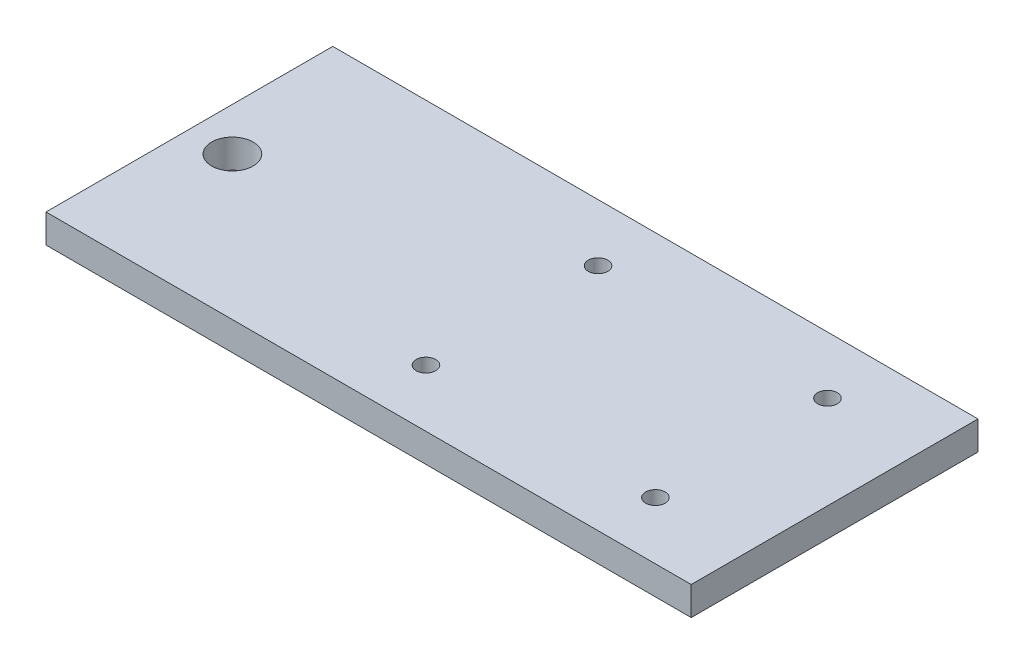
from build123d import *

# Parameters (mm, degrees)
ESQUISSE1_W             = 100
ESQUISSE1_H             = 10
EXTRUSION1_DEPTH        = 112.5
ESQUISSE2_R             = 7.25
ENL_V_MAT_EXTRU_1_DEPTH = 210
TROU_TARAUD_M8X1_251_D  = 6.8


with BuildPart() as part:
    # Esquisse1 → Extrusion1 (new, symmetric)
    with BuildSketch(Plane(origin=(0, 0, 0), x_dir=(0, 0, -1), z_dir=(1, 0, 0))):
        with Locations((0, -5)):
            Rectangle(ESQUISSE1_W, ESQUISSE1_H)
    extrude(amount=EXTRUSION1_DEPTH, both=True)

    # Esquisse2 → Enl_v. mat.-Extru.1 (cut)
    with BuildSketch(Plane(origin=(0, 0, 0), x_dir=(-1, 0, 0), z_dir=(0, 1, 0))):
        with Locations(Location((97.5, 0, 0), (0, 0, 90))):
            Circle(ESQUISSE2_R)
    extrude(amount=-ENL_V_MAT_EXTRU_1_DEPTH, mode=Mode.SUBTRACT)

    # Trou taraud_ M8x1.251 (through all)
    with Locations(Plane(origin=(0, 0, 0), x_dir=(-1, 0, 0), z_dir=(0, 1, 0))):
        with Locations((0, 30), (0, -30), (-80, -30), (-80, 30)):
            Hole(TROU_TARAUD_M8X1_251_D / 2)


solid = part.part
